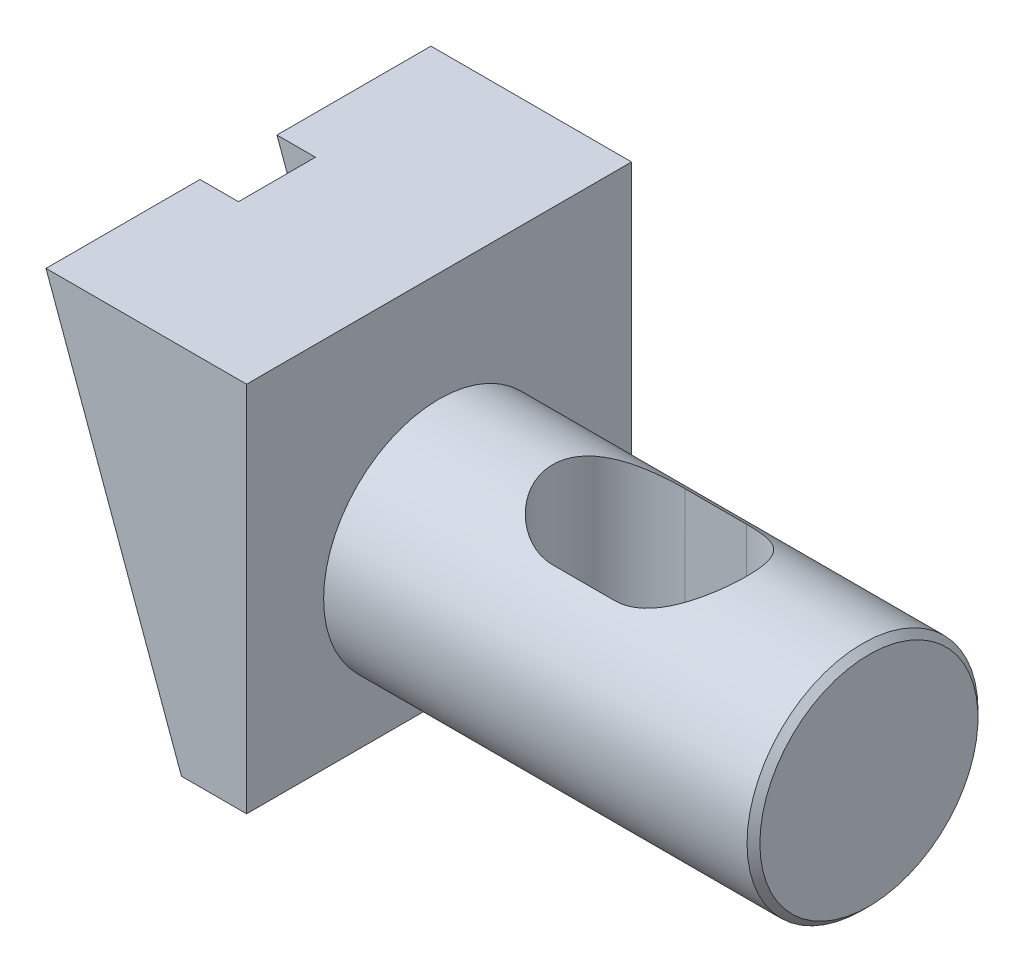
ISO-10303-21;
HEADER;
FILE_DESCRIPTION(('STEP AP214'),'2;1');
FILE_NAME('part.step','',(''),(''),'','','');
FILE_SCHEMA(('AUTOMOTIVE_DESIGN { 1 0 10303 214 1 1 1 1 }'));
ENDSEC;
DATA;
#1=APPLICATION_CONTEXT('core data for automotive mechanical design processes');
#2=APPLICATION_PROTOCOL_DEFINITION('international standard','automotive_design',2000,#1);
#3=PRODUCT_CONTEXT('',#1,'mechanical');
#4=PRODUCT('Part','Part','',(#3));
#5=PRODUCT_RELATED_PRODUCT_CATEGORY('part','',(#4));
#6=PRODUCT_DEFINITION_FORMATION('','',#4);
#7=PRODUCT_DEFINITION_CONTEXT('part definition',#1,'design');
#8=PRODUCT_DEFINITION('design','',#6,#7);
#9=PRODUCT_DEFINITION_SHAPE('','',#8);
#10=(LENGTH_UNIT() NAMED_UNIT(*) SI_UNIT(.MILLI.,.METRE.));
#11=(NAMED_UNIT(*) PLANE_ANGLE_UNIT() SI_UNIT($,.RADIAN.));
#12=(NAMED_UNIT(*) SI_UNIT($,.STERADIAN.) SOLID_ANGLE_UNIT());
#13=UNCERTAINTY_MEASURE_WITH_UNIT(LENGTH_MEASURE(1.E-05),#10,'distance_accuracy_value','');
#14=(GEOMETRIC_REPRESENTATION_CONTEXT(3) GLOBAL_UNCERTAINTY_ASSIGNED_CONTEXT((#13)) GLOBAL_UNIT_ASSIGNED_CONTEXT((#10,
#11,#12)) REPRESENTATION_CONTEXT('',''));
#15=CARTESIAN_POINT('',(0.,0.,0.));
#16=DIRECTION('',(0.,0.,1.));
#17=DIRECTION('',(1.,0.,0.));
#18=AXIS2_PLACEMENT_3D('',#15,#16,#17);
#19=CARTESIAN_POINT('',(-51.1,15.5,0.));
#20=DIRECTION('',(1.,0.,0.));
#21=DIRECTION('',(0.,0.,-1.));
#22=AXIS2_PLACEMENT_3D('',#19,#20,#21);
#23=PLANE('',#22);
#24=CARTESIAN_POINT('',(-51.1,15.5,0.));
#25=DIRECTION('',(-1.,0.,0.));
#26=DIRECTION('',(0.,0.,1.));
#27=AXIS2_PLACEMENT_3D('',#24,#25,#26);
#28=CIRCLE('',#27,7.5);
#29=CARTESIAN_POINT('',(-51.1,15.5,7.5));
#30=VERTEX_POINT('',#29);
#31=EDGE_CURVE('E253',#30,#30,#28,.T.);
#32=ORIENTED_EDGE('',*,*,#31,.T.);
#33=EDGE_LOOP('',(#32));
#34=FACE_BOUND('',#33,.T.);
#35=CARTESIAN_POINT('',(-51.1,15.5,0.));
#36=DIRECTION('',(1.,0.,0.));
#37=DIRECTION('',(0.,0.,-1.));
#38=AXIS2_PLACEMENT_3D('',#35,#36,#37);
#39=CIRCLE('',#38,2.);
#40=CARTESIAN_POINT('',(-51.1,15.5,-2.));
#41=VERTEX_POINT('',#40);
#42=EDGE_CURVE('E11',#41,#41,#39,.F.);
#43=ORIENTED_EDGE('',*,*,#42,.F.);
#44=EDGE_LOOP('',(#43));
#45=FACE_BOUND('',#44,.T.);
#46=ADVANCED_FACE('F34',(#34,#45),#23,.F.);
#47=CARTESIAN_POINT('',(-36.1,24.,0.));
#48=DIRECTION('',(-1.,0.,0.));
#49=DIRECTION('',(0.,0.,1.));
#50=AXIS2_PLACEMENT_3D('',#47,#48,#49);
#51=PLANE('',#50);
#52=CARTESIAN_POINT('',(-36.1,15.5,0.));
#53=DIRECTION('',(-1.,0.,0.));
#54=DIRECTION('',(0.,0.,1.));
#55=AXIS2_PLACEMENT_3D('',#52,#53,#54);
#56=CIRCLE('',#55,8.5);
#57=CARTESIAN_POINT('',(-36.1,15.5,8.5));
#58=VERTEX_POINT('',#57);
#59=EDGE_CURVE('E256',#58,#58,#56,.T.);
#60=ORIENTED_EDGE('',*,*,#59,.T.);
#61=EDGE_LOOP('',(#60));
#62=FACE_BOUND('',#61,.T.);
#63=CARTESIAN_POINT('',(-36.1,15.5,0.));
#64=DIRECTION('',(-1.,0.,0.));
#65=DIRECTION('',(0.,0.,1.));
#66=AXIS2_PLACEMENT_3D('',#63,#64,#65);
#67=CIRCLE('',#66,7.5);
#68=CARTESIAN_POINT('',(-36.1,15.5,7.5));
#69=VERTEX_POINT('',#68);
#70=EDGE_CURVE('E250',#69,#69,#67,.T.);
#71=ORIENTED_EDGE('',*,*,#70,.F.);
#72=EDGE_LOOP('',(#71));
#73=FACE_BOUND('',#72,.T.);
#74=ADVANCED_FACE('F432',(#62,#73),#51,.T.);
#75=CARTESIAN_POINT('',(-49.136029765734,29.,15.));
#76=DIRECTION('',(0.939692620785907,0.342020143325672,0.));
#77=DIRECTION('',(-0.342020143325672,0.939692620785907,0.));
#78=AXIS2_PLACEMENT_3D('',#75,#76,#77);
#79=PLANE('',#78);
#80=CARTESIAN_POINT('',(-44.2224316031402,15.5,0.));
#81=DIRECTION('',(0.939692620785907,0.342020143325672,0.));
#82=DIRECTION('',(-0.342020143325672,0.939692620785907,0.));
#83=AXIS2_PLACEMENT_3D('',#80,#81,#82);
#84=ELLIPSE('',#83,9.04551106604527,8.5);
#85=CARTESIAN_POINT('',(-47.1170820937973,23.4529868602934,-3.));
#86=VERTEX_POINT('',#85);
#87=CARTESIAN_POINT('',(-41.3277811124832,7.54701313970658,-3.));
#88=VERTEX_POINT('',#87);
#89=EDGE_CURVE('E265',#86,#88,#84,.F.);
#90=ORIENTED_EDGE('',*,*,#89,.F.);
#91=DIRECTION('',(0.342020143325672,-0.939692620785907,0.));
#92=VECTOR('',#91,1.);
#93=CARTESIAN_POINT('',(-49.136029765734,29.,-3.));
#94=LINE('',#93,#92);
#95=CARTESIAN_POINT('',(-49.136029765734,29.,-3.));
#96=VERTEX_POINT('',#95);
#97=EDGE_CURVE('E292',#96,#86,#94,.T.);
#98=ORIENTED_EDGE('',*,*,#97,.F.);
#99=DIRECTION('',(0.,0.,-1.));
#100=VECTOR('',#99,1.);
#101=CARTESIAN_POINT('',(-49.136029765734,29.,15.));
#102=LINE('',#101,#100);
#103=CARTESIAN_POINT('',(-49.136029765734,29.,-15.));
#104=VERTEX_POINT('',#103);
#105=EDGE_CURVE('E339',#96,#104,#102,.T.);
#106=ORIENTED_EDGE('',*,*,#105,.T.);
#107=DIRECTION('',(0.342020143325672,-0.939692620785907,0.));
#108=VECTOR('',#107,1.);
#109=CARTESIAN_POINT('',(-49.136029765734,29.,-15.));
#110=LINE('',#109,#108);
#111=CARTESIAN_POINT('',(-38.580892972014,0.,-15.));
#112=VERTEX_POINT('',#111);
#113=EDGE_CURVE('E313',#104,#112,#110,.T.);
#114=ORIENTED_EDGE('',*,*,#113,.T.);
#115=DIRECTION('',(0.,0.,-1.));
#116=VECTOR('',#115,1.);
#117=CARTESIAN_POINT('',(-38.580892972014,0.,15.));
#118=LINE('',#117,#116);
#119=CARTESIAN_POINT('',(-38.580892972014,0.,-3.));
#120=VERTEX_POINT('',#119);
#121=EDGE_CURVE('E335',#120,#112,#118,.T.);
#122=ORIENTED_EDGE('',*,*,#121,.F.);
#123=EDGE_CURVE('E291',#88,#120,#94,.T.);
#124=ORIENTED_EDGE('',*,*,#123,.F.);
#125=EDGE_LOOP('',(#90,#98,#106,#114,#122,#124));
#126=FACE_BOUND('',#125,.T.);
#127=ADVANCED_FACE('F438',(#126),#79,.F.);
#128=CARTESIAN_POINT('',(-44.2224316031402,15.5,0.));
#129=DIRECTION('',(0.939692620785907,0.342020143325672,0.));
#130=DIRECTION('',(-0.342020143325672,0.939692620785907,0.));
#131=AXIS2_PLACEMENT_3D('',#128,#129,#130);
#132=ELLIPSE('',#131,9.04551106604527,8.5);
#133=CARTESIAN_POINT('',(-41.3277811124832,7.54701313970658,3.));
#134=VERTEX_POINT('',#133);
#135=CARTESIAN_POINT('',(-47.1170820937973,23.4529868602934,3.));
#136=VERTEX_POINT('',#135);
#137=EDGE_CURVE('E263',#134,#136,#132,.F.);
#138=ORIENTED_EDGE('',*,*,#137,.F.);
#139=DIRECTION('',(0.342020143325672,-0.939692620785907,0.));
#140=VECTOR('',#139,1.);
#141=CARTESIAN_POINT('',(-49.136029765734,29.,3.));
#142=LINE('',#141,#140);
#143=CARTESIAN_POINT('',(-38.580892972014,0.,3.));
#144=VERTEX_POINT('',#143);
#145=EDGE_CURVE('E295',#134,#144,#142,.T.);
#146=ORIENTED_EDGE('',*,*,#145,.T.);
#147=CARTESIAN_POINT('',(-38.580892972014,0.,15.));
#148=VERTEX_POINT('',#147);
#149=EDGE_CURVE('E336',#148,#144,#118,.T.);
#150=ORIENTED_EDGE('',*,*,#149,.F.);
#151=DIRECTION('',(0.342020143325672,-0.939692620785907,0.));
#152=VECTOR('',#151,1.);
#153=CARTESIAN_POINT('',(-49.136029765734,29.,15.));
#154=LINE('',#153,#152);
#155=CARTESIAN_POINT('',(-49.136029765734,29.,15.));
#156=VERTEX_POINT('',#155);
#157=EDGE_CURVE('E325',#156,#148,#154,.T.);
#158=ORIENTED_EDGE('',*,*,#157,.F.);
#159=CARTESIAN_POINT('',(-49.136029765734,29.,3.));
#160=VERTEX_POINT('',#159);
#161=EDGE_CURVE('E340',#156,#160,#102,.T.);
#162=ORIENTED_EDGE('',*,*,#161,.T.);
#163=EDGE_CURVE('E296',#160,#136,#142,.T.);
#164=ORIENTED_EDGE('',*,*,#163,.T.);
#165=EDGE_LOOP('',(#138,#146,#150,#158,#162,#164));
#166=FACE_BOUND('',#165,.T.);
#167=ADVANCED_FACE('F457',(#166),#79,.F.);
#168=CARTESIAN_POINT('',(-58.5,0.,3.));
#169=DIRECTION('',(0.,0.,1.));
#170=DIRECTION('',(1.,0.,0.));
#171=AXIS2_PLACEMENT_3D('',#168,#169,#170);
#172=PLANE('',#171);
#173=DIRECTION('',(-1.,0.,0.));
#174=VECTOR('',#173,1.);
#175=CARTESIAN_POINT('',(-36.1,23.4529868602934,3.));
#176=LINE('',#175,#174);
#177=CARTESIAN_POINT('',(-44.1170820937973,23.4529868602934,3.));
#178=VERTEX_POINT('',#177);
#179=EDGE_CURVE('E58',#136,#178,#176,.F.);
#180=ORIENTED_EDGE('',*,*,#179,.F.);
#181=ORIENTED_EDGE('',*,*,#163,.F.);
#182=DIRECTION('',(-1.,0.,0.));
#183=VECTOR('',#182,1.);
#184=CARTESIAN_POINT('',(-46.136029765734,29.,3.));
#185=LINE('',#184,#183);
#186=CARTESIAN_POINT('',(-46.136029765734,29.,3.));
#187=VERTEX_POINT('',#186);
#188=EDGE_CURVE('E282',#187,#160,#185,.T.);
#189=ORIENTED_EDGE('',*,*,#188,.F.);
#190=DIRECTION('',(-0.342020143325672,0.939692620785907,0.));
#191=VECTOR('',#190,1.);
#192=CARTESIAN_POINT('',(-35.580892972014,0.,3.));
#193=LINE('',#192,#191);
#194=EDGE_CURVE('E278',#178,#187,#193,.T.);
#195=ORIENTED_EDGE('',*,*,#194,.F.);
#196=EDGE_LOOP('',(#180,#181,#189,#195));
#197=FACE_BOUND('',#196,.T.);
#198=ADVANCED_FACE('F455',(#197),#172,.F.);
#199=DIRECTION('',(-1.,0.,0.));
#200=VECTOR('',#199,1.);
#201=CARTESIAN_POINT('',(-36.1,7.54701313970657,3.));
#202=LINE('',#201,#200);
#203=CARTESIAN_POINT('',(-38.3277811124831,7.54701313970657,3.));
#204=VERTEX_POINT('',#203);
#205=EDGE_CURVE('E270',#204,#134,#202,.T.);
#206=ORIENTED_EDGE('',*,*,#205,.F.);
#207=CARTESIAN_POINT('',(-35.580892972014,0.,3.));
#208=VERTEX_POINT('',#207);
#209=EDGE_CURVE('E279',#208,#204,#193,.T.);
#210=ORIENTED_EDGE('',*,*,#209,.F.);
#211=DIRECTION('',(1.,0.,0.));
#212=VECTOR('',#211,1.);
#213=CARTESIAN_POINT('',(-38.580892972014,0.,3.));
#214=LINE('',#213,#212);
#215=EDGE_CURVE('E473',#144,#208,#214,.T.);
#216=ORIENTED_EDGE('',*,*,#215,.F.);
#217=ORIENTED_EDGE('',*,*,#145,.F.);
#218=EDGE_LOOP('',(#206,#210,#216,#217));
#219=FACE_BOUND('',#218,.T.);
#220=ADVANCED_FACE('F453',(#219),#172,.F.);
#221=CARTESIAN_POINT('',(-58.5,0.,-3.));
#222=DIRECTION('',(0.,0.,1.));
#223=DIRECTION('',(1.,0.,0.));
#224=AXIS2_PLACEMENT_3D('',#221,#222,#223);
#225=PLANE('',#224);
#226=ORIENTED_EDGE('',*,*,#97,.T.);
#227=DIRECTION('',(-1.,0.,0.));
#228=VECTOR('',#227,1.);
#229=CARTESIAN_POINT('',(-36.1,23.4529868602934,-3.));
#230=LINE('',#229,#228);
#231=CARTESIAN_POINT('',(-44.1170820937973,23.4529868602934,-3.));
#232=VERTEX_POINT('',#231);
#233=EDGE_CURVE('E259',#86,#232,#230,.F.);
#234=ORIENTED_EDGE('',*,*,#233,.T.);
#235=DIRECTION('',(-0.342020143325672,0.939692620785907,0.));
#236=VECTOR('',#235,1.);
#237=CARTESIAN_POINT('',(-35.580892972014,0.,-3.));
#238=LINE('',#237,#236);
#239=CARTESIAN_POINT('',(-46.136029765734,29.,-3.));
#240=VERTEX_POINT('',#239);
#241=EDGE_CURVE('E272',#232,#240,#238,.T.);
#242=ORIENTED_EDGE('',*,*,#241,.T.);
#243=DIRECTION('',(-1.,0.,0.));
#244=VECTOR('',#243,1.);
#245=CARTESIAN_POINT('',(-46.136029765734,29.,-3.));
#246=LINE('',#245,#244);
#247=EDGE_CURVE('E276',#240,#96,#246,.T.);
#248=ORIENTED_EDGE('',*,*,#247,.T.);
#249=EDGE_LOOP('',(#226,#234,#242,#248));
#250=FACE_BOUND('',#249,.T.);
#251=ADVANCED_FACE('F449',(#250),#225,.T.);
#252=CARTESIAN_POINT('',(-35.580892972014,0.,-3.));
#253=VERTEX_POINT('',#252);
#254=CARTESIAN_POINT('',(-38.3277811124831,7.54701313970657,-3.));
#255=VERTEX_POINT('',#254);
#256=EDGE_CURVE('E273',#253,#255,#238,.T.);
#257=ORIENTED_EDGE('',*,*,#256,.T.);
#258=DIRECTION('',(-1.,0.,0.));
#259=VECTOR('',#258,1.);
#260=CARTESIAN_POINT('',(-36.1,7.54701313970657,-3.));
#261=LINE('',#260,#259);
#262=EDGE_CURVE('E267',#255,#88,#261,.T.);
#263=ORIENTED_EDGE('',*,*,#262,.T.);
#264=ORIENTED_EDGE('',*,*,#123,.T.);
#265=DIRECTION('',(1.,0.,0.));
#266=VECTOR('',#265,1.);
#267=CARTESIAN_POINT('',(-38.580892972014,0.,-3.));
#268=LINE('',#267,#266);
#269=EDGE_CURVE('E389',#120,#253,#268,.T.);
#270=ORIENTED_EDGE('',*,*,#269,.T.);
#271=EDGE_LOOP('',(#257,#263,#264,#270));
#272=FACE_BOUND('',#271,.T.);
#273=ADVANCED_FACE('F452',(#272),#225,.T.);
#274=CARTESIAN_POINT('',(-35.580892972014,0.,3.));
#275=DIRECTION('',(-0.939692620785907,-0.342020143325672,0.));
#276=DIRECTION('',(0.342020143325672,-0.939692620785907,0.));
#277=AXIS2_PLACEMENT_3D('',#274,#275,#276);
#278=PLANE('',#277);
#279=ORIENTED_EDGE('',*,*,#209,.T.);
#280=CARTESIAN_POINT('',(-41.2224316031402,15.5,0.));
#281=DIRECTION('',(-0.939692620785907,-0.342020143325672,0.));
#282=DIRECTION('',(-0.342020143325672,0.939692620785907,0.));
#283=AXIS2_PLACEMENT_3D('',#280,#281,#282);
#284=ELLIPSE('',#283,9.04551106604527,8.5);
#285=EDGE_CURVE('E43',#204,#255,#284,.F.);
#286=ORIENTED_EDGE('',*,*,#285,.T.);
#287=ORIENTED_EDGE('',*,*,#256,.F.);
#288=DIRECTION('',(0.,0.,-1.));
#289=VECTOR('',#288,1.);
#290=CARTESIAN_POINT('',(-35.580892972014,0.,3.));
#291=LINE('',#290,#289);
#292=EDGE_CURVE('E288',#208,#253,#291,.T.);
#293=ORIENTED_EDGE('',*,*,#292,.F.);
#294=EDGE_LOOP('',(#279,#286,#287,#293));
#295=FACE_BOUND('',#294,.T.);
#296=ADVANCED_FACE('F429',(#295),#278,.T.);
#297=ORIENTED_EDGE('',*,*,#241,.F.);
#298=EDGE_CURVE('E479',#232,#178,#284,.F.);
#299=ORIENTED_EDGE('',*,*,#298,.T.);
#300=ORIENTED_EDGE('',*,*,#194,.T.);
#301=DIRECTION('',(0.,0.,-1.));
#302=VECTOR('',#301,1.);
#303=CARTESIAN_POINT('',(-46.136029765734,29.,3.));
#304=LINE('',#303,#302);
#305=EDGE_CURVE('E285',#187,#240,#304,.T.);
#306=ORIENTED_EDGE('',*,*,#305,.T.);
#307=EDGE_LOOP('',(#297,#299,#300,#306));
#308=FACE_BOUND('',#307,.T.);
#309=ADVANCED_FACE('F422',(#308),#278,.T.);
#310=CARTESIAN_POINT('',(0.,11.5,0.));
#311=DIRECTION('',(-1.,0.,0.));
#312=DIRECTION('',(0.,0.,1.));
#313=AXIS2_PLACEMENT_3D('',#310,#311,#312);
#314=CYLINDRICAL_SURFACE('',#313,9.);
#315=CARTESIAN_POINT('',(-19.5,4.11911251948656,5.15));
#316=CARTESIAN_POINT('',(-19.6316313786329,4.11916277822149,5.15002763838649));
#317=CARTESIAN_POINT('',(-19.7632338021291,4.11559254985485,5.14495444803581));
#318=CARTESIAN_POINT('',(-20.025196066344,4.10159238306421,5.12482541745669));
#319=CARTESIAN_POINT('',(-20.1555568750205,4.09116832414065,5.10977813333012));
#320=CARTESIAN_POINT('',(-20.4131346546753,4.0639405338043,5.07006506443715));
#321=CARTESIAN_POINT('',(-20.5403676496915,4.04718404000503,5.04547046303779));
#322=CARTESIAN_POINT('',(-20.7917739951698,4.00795447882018,4.9870324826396));
#323=CARTESIAN_POINT('',(-20.9159468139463,3.98548042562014,4.95318750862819));
#324=CARTESIAN_POINT('',(-21.2819234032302,3.91079860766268,4.83863073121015));
#325=CARTESIAN_POINT('',(-21.5182311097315,3.85120998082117,4.74473138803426));
#326=CARTESIAN_POINT('',(-21.9719164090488,3.71922672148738,4.52503539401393));
#327=CARTESIAN_POINT('',(-22.1892538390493,3.64680585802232,4.39917317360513));
#328=CARTESIAN_POINT('',(-22.6246404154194,3.48779385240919,4.10314275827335));
#329=CARTESIAN_POINT('',(-22.84016992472,3.40051910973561,3.92963517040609));
#330=CARTESIAN_POINT('',(-23.2411412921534,3.22709656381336,3.55000595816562));
#331=CARTESIAN_POINT('',(-23.4265730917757,3.1409491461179,3.34387347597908));
#332=CARTESIAN_POINT('',(-23.6871361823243,3.01453309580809,3.0022591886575));
#333=CARTESIAN_POINT('',(-23.7742586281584,2.97111647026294,2.87691702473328));
#334=CARTESIAN_POINT('',(-23.9375132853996,2.88814346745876,2.61808344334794));
#335=CARTESIAN_POINT('',(-24.0136499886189,2.84858551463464,2.48459538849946));
#336=CARTESIAN_POINT('',(-24.1541265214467,2.77447211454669,2.21028201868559));
#337=CARTESIAN_POINT('',(-24.2184705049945,2.73991490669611,2.06945930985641));
#338=CARTESIAN_POINT('',(-24.3345786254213,2.67683318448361,1.781417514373));
#339=CARTESIAN_POINT('',(-24.3863446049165,2.64830778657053,1.63419936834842));
#340=CARTESIAN_POINT('',(-24.4725367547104,2.60042380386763,1.34785522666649));
#341=CARTESIAN_POINT('',(-24.5080925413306,2.58047712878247,1.20916719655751));
#342=CARTESIAN_POINT('',(-24.5676224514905,2.54691722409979,0.928581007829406));
#343=CARTESIAN_POINT('',(-24.5915981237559,2.533303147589,0.786683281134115));
#344=CARTESIAN_POINT('',(-24.6275946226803,2.51281425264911,0.50098889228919));
#345=CARTESIAN_POINT('',(-24.6396232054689,2.50593506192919,0.357193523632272));
#346=CARTESIAN_POINT('',(-24.651557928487,2.49910983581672,0.068941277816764));
#347=CARTESIAN_POINT('',(-24.6514651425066,2.49916318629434,-0.0755155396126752));
#348=CARTESIAN_POINT('',(-24.6398627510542,2.50579781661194,-0.34737466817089));
#349=CARTESIAN_POINT('',(-24.6296492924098,2.51163797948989,-0.474852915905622));
#350=CARTESIAN_POINT('',(-24.5998283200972,2.52862337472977,-0.728387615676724));
#351=CARTESIAN_POINT('',(-24.5802179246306,2.53977023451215,-0.854443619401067));
#352=CARTESIAN_POINT('',(-24.5318430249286,2.56710883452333,-1.1041843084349));
#353=CARTESIAN_POINT('',(-24.5030817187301,2.58329881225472,-1.22786980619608));
#354=CARTESIAN_POINT('',(-24.4367318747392,2.6203562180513,-1.4721497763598));
#355=CARTESIAN_POINT('',(-24.3991399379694,2.64122544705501,-1.59274303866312));
#356=CARTESIAN_POINT('',(-24.2729648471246,2.71059396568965,-1.95078966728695));
#357=CARTESIAN_POINT('',(-24.1713677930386,2.76562959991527,-2.18254696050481));
#358=CARTESIAN_POINT('',(-23.9373122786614,2.88853364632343,-2.62598165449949));
#359=CARTESIAN_POINT('',(-23.8048449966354,2.9564057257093,-2.83765329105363));
#360=CARTESIAN_POINT('',(-23.495811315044,3.10810854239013,-3.26069824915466));
#361=CARTESIAN_POINT('',(-23.3159512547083,3.19287603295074,-3.46932843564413));
#362=CARTESIAN_POINT('',(-22.9256263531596,3.36478696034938,-3.85525714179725));
#363=CARTESIAN_POINT('',(-22.7151189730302,3.45193356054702,-4.03251134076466));
#364=CARTESIAN_POINT('',(-22.367889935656,3.58234507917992,-4.28026511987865));
#365=CARTESIAN_POINT('',(-22.240495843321,3.62773840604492,-4.36295432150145));
#366=CARTESIAN_POINT('',(-21.977974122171,3.71523669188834,-4.51722423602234));
#367=CARTESIAN_POINT('',(-21.8428445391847,3.75734081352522,-4.5888021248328));
#368=CARTESIAN_POINT('',(-21.5659443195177,3.83657535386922,-4.71993468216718));
#369=CARTESIAN_POINT('',(-21.4241924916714,3.87371882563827,-4.77952112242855));
#370=CARTESIAN_POINT('',(-21.1346392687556,3.94157559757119,-4.88612508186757));
#371=CARTESIAN_POINT('',(-20.9868428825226,3.97229409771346,-4.9331527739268));
#372=CARTESIAN_POINT('',(-20.7290535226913,4.01823108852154,-5.00243268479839));
#373=CARTESIAN_POINT('',(-20.6202632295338,4.0353731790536,-5.02792730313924));
#374=CARTESIAN_POINT('',(-20.4006803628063,4.06515659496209,-5.07186413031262));
#375=CARTESIAN_POINT('',(-20.289888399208,4.07779926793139,-5.09030845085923));
#376=CARTESIAN_POINT('',(-20.0663257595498,4.09825669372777,-5.12001394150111));
#377=CARTESIAN_POINT('',(-19.9535479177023,4.10604675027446,-5.13123837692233));
#378=CARTESIAN_POINT('',(-19.7271849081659,4.11649078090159,-5.14624199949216));
#379=CARTESIAN_POINT('',(-19.6135992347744,4.11914118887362,-5.15001601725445));
#380=CARTESIAN_POINT('',(-19.5,4.11911251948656,-5.15));
#381=B_SPLINE_CURVE_WITH_KNOTS('',3,(#315,#316,#317,#318,#319,#320,#321,#322,#323,#324,#325,
#326,#327,#328,#329,#330,#331,#332,#333,#334,#335,#336,#337,#338,#339,#340,#341,#342,#343,#344,
#345,#346,#347,#348,#349,#350,#351,#352,#353,#354,#355,#356,#357,#358,#359,#360,#361,#362,#363,
#364,#365,#366,#367,#368,#369,#370,#371,#372,#373,#374,#375,#376,#377,#378,#379,#380),
.UNSPECIFIED.,.F.,.F.,(4,2,2,2,2,2,2,2,2,2,2,2,2,2,2,2,2,2,2,2,2,2,2,2,2,2,2,2,2,2,2,2,4),(0.,
0.394700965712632,0.789063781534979,1.18054107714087,1.57208591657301,2.35201880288,
3.13356477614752,4.00055056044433,4.86782549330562,5.34339177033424,5.81876304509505,
6.29396654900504,6.76910039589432,7.20215657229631,7.63515481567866,8.06787176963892,
8.50055039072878,8.8841524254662,9.26787217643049,9.6514579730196,10.0351916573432,
10.8086275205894,11.5822846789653,12.443470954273,13.3058641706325,13.7809017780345,
14.2560599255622,14.729942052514,15.2034391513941,15.5422767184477,15.8810127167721,
16.221458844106,16.5621411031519),.UNSPECIFIED.);
#382=CARTESIAN_POINT('',(-19.5,4.11911251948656,5.15));
#383=VERTEX_POINT('',#382);
#384=CARTESIAN_POINT('',(-19.5,4.11911251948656,-5.15));
#385=VERTEX_POINT('',#384);
#386=EDGE_CURVE('E399',#383,#385,#381,.T.);
#387=ORIENTED_EDGE('',*,*,#386,.F.);
#388=DIRECTION('',(-1.,0.,0.));
#389=VECTOR('',#388,1.);
#390=CARTESIAN_POINT('',(0.,4.11911251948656,5.15));
#391=LINE('',#390,#389);
#392=CARTESIAN_POINT('',(-14.7,4.11911251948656,5.15));
#393=VERTEX_POINT('',#392);
#394=EDGE_CURVE('E360',#393,#383,#391,.T.);
#395=ORIENTED_EDGE('',*,*,#394,.F.);
#396=CARTESIAN_POINT('',(-14.7,4.11911251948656,-5.15));
#397=CARTESIAN_POINT('',(-14.568368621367,4.11916277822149,-5.15002763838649));
#398=CARTESIAN_POINT('',(-14.4367661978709,4.11559254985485,-5.14495444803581));
#399=CARTESIAN_POINT('',(-14.174803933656,4.10159238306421,-5.12482541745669));
#400=CARTESIAN_POINT('',(-14.0444431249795,4.09116832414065,-5.10977813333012));
#401=CARTESIAN_POINT('',(-13.7868653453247,4.0639405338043,-5.07006506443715));
#402=CARTESIAN_POINT('',(-13.6596323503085,4.04718404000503,-5.04547046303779));
#403=CARTESIAN_POINT('',(-13.4082260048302,4.00795447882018,-4.9870324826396));
#404=CARTESIAN_POINT('',(-13.2840531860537,3.98548042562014,-4.95318750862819));
#405=CARTESIAN_POINT('',(-12.9180765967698,3.91079860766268,-4.83863073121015));
#406=CARTESIAN_POINT('',(-12.6817688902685,3.85120998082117,-4.74473138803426));
#407=CARTESIAN_POINT('',(-12.2280835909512,3.71922672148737,-4.52503539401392));
#408=CARTESIAN_POINT('',(-12.0107461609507,3.64680585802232,-4.39917317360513));
#409=CARTESIAN_POINT('',(-11.5753595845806,3.48779385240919,-4.10314275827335));
#410=CARTESIAN_POINT('',(-11.35983007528,3.40051910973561,-3.92963517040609));
#411=CARTESIAN_POINT('',(-10.9588587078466,3.22709656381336,-3.55000595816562));
#412=CARTESIAN_POINT('',(-10.7734269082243,3.1409491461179,-3.34387347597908));
#413=CARTESIAN_POINT('',(-10.5128638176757,3.01453309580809,-3.00225918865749));
#414=CARTESIAN_POINT('',(-10.4257413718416,2.97111647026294,-2.87691702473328));
#415=CARTESIAN_POINT('',(-10.2624867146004,2.88814346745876,-2.61808344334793));
#416=CARTESIAN_POINT('',(-10.1863500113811,2.84858551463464,-2.48459538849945));
#417=CARTESIAN_POINT('',(-10.0458734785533,2.77447211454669,-2.21028201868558));
#418=CARTESIAN_POINT('',(-9.98152949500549,2.73991490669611,-2.0694593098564));
#419=CARTESIAN_POINT('',(-9.86542137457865,2.67683318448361,-1.781417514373));
#420=CARTESIAN_POINT('',(-9.81365539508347,2.64830778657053,-1.63419936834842));
#421=CARTESIAN_POINT('',(-9.72746324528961,2.60042380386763,-1.34785522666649));
#422=CARTESIAN_POINT('',(-9.69190745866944,2.58047712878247,-1.20916719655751));
#423=CARTESIAN_POINT('',(-9.63237754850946,2.54691722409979,-0.928581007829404));
#424=CARTESIAN_POINT('',(-9.60840187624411,2.533303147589,-0.786683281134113));
#425=CARTESIAN_POINT('',(-9.57240537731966,2.51281425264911,-0.50098889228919));
#426=CARTESIAN_POINT('',(-9.5603767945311,2.50593506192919,-0.357193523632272));
#427=CARTESIAN_POINT('',(-9.54844207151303,2.49910983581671,-0.0689412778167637));
#428=CARTESIAN_POINT('',(-9.54853485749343,2.49916318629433,0.0755155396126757));
#429=CARTESIAN_POINT('',(-9.56013724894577,2.50579781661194,0.347374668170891));
#430=CARTESIAN_POINT('',(-9.57035070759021,2.51163797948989,0.474852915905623));
#431=CARTESIAN_POINT('',(-9.60017167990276,2.52862337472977,0.728387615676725));
#432=CARTESIAN_POINT('',(-9.61978207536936,2.53977023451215,0.854443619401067));
#433=CARTESIAN_POINT('',(-9.66815697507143,2.56710883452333,1.1041843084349));
#434=CARTESIAN_POINT('',(-9.69691828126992,2.58329881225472,1.22786980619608));
#435=CARTESIAN_POINT('',(-9.76326812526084,2.6203562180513,1.4721497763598));
#436=CARTESIAN_POINT('',(-9.80086006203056,2.64122544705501,1.59274303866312));
#437=CARTESIAN_POINT('',(-9.92703515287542,2.71059396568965,1.95078966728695));
#438=CARTESIAN_POINT('',(-10.0286322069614,2.76562959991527,2.18254696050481));
#439=CARTESIAN_POINT('',(-10.2626877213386,2.88853364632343,2.6259816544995));
#440=CARTESIAN_POINT('',(-10.3951550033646,2.9564057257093,2.83765329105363));
#441=CARTESIAN_POINT('',(-10.704188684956,3.10810854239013,3.26069824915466));
#442=CARTESIAN_POINT('',(-10.8840487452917,3.19287603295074,3.46932843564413));
#443=CARTESIAN_POINT('',(-11.2743736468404,3.36478696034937,3.85525714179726));
#444=CARTESIAN_POINT('',(-11.4848810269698,3.45193356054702,4.03251134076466));
#445=CARTESIAN_POINT('',(-11.832110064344,3.58234507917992,4.28026511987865));
#446=CARTESIAN_POINT('',(-11.959504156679,3.62773840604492,4.36295432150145));
#447=CARTESIAN_POINT('',(-12.222025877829,3.71523669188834,4.51722423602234));
#448=CARTESIAN_POINT('',(-12.3571554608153,3.75734081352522,4.58880212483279));
#449=CARTESIAN_POINT('',(-12.6340556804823,3.83657535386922,4.71993468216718));
#450=CARTESIAN_POINT('',(-12.7758075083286,3.87371882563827,4.77952112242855));
#451=CARTESIAN_POINT('',(-13.0653607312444,3.94157559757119,4.88612508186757));
#452=CARTESIAN_POINT('',(-13.2131571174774,3.97229409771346,4.93315277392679));
#453=CARTESIAN_POINT('',(-13.4709464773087,4.01823108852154,5.00243268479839));
#454=CARTESIAN_POINT('',(-13.5797367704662,4.03537317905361,5.02792730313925));
#455=CARTESIAN_POINT('',(-13.7993196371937,4.06515659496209,5.07186413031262));
#456=CARTESIAN_POINT('',(-13.910111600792,4.07779926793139,5.09030845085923));
#457=CARTESIAN_POINT('',(-14.1336742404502,4.09825669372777,5.12001394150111));
#458=CARTESIAN_POINT('',(-14.2464520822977,4.10604675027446,5.13123837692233));
#459=CARTESIAN_POINT('',(-14.4728150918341,4.11649078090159,5.14624199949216));
#460=CARTESIAN_POINT('',(-14.5864007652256,4.11914118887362,5.15001601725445));
#461=CARTESIAN_POINT('',(-14.7,4.11911251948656,5.15));
#462=B_SPLINE_CURVE_WITH_KNOTS('',3,(#396,#397,#398,#399,#400,#401,#402,#403,#404,#405,#406,
#407,#408,#409,#410,#411,#412,#413,#414,#415,#416,#417,#418,#419,#420,#421,#422,#423,#424,#425,
#426,#427,#428,#429,#430,#431,#432,#433,#434,#435,#436,#437,#438,#439,#440,#441,#442,#443,#444,
#445,#446,#447,#448,#449,#450,#451,#452,#453,#454,#455,#456,#457,#458,#459,#460,#461),
.UNSPECIFIED.,.F.,.F.,(4,2,2,2,2,2,2,2,2,2,2,2,2,2,2,2,2,2,2,2,2,2,2,2,2,2,2,2,2,2,2,2,4),(0.,
0.394700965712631,0.789063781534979,1.18054107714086,1.57208591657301,2.35201880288,
3.13356477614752,4.00055056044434,4.86782549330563,5.34339177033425,5.81876304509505,
6.29396654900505,6.76910039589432,7.20215657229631,7.63515481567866,8.06787176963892,
8.50055039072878,8.8841524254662,9.26787217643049,9.65145797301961,10.0351916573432,
10.8086275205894,11.5822846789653,12.443470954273,13.3058641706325,13.7809017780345,
14.2560599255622,14.729942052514,15.2034391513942,15.5422767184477,15.8810127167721,
16.221458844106,16.5621411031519),.UNSPECIFIED.);
#463=CARTESIAN_POINT('',(-14.7,4.11911251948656,-5.15));
#464=VERTEX_POINT('',#463);
#465=EDGE_CURVE('E354',#464,#393,#462,.T.);
#466=ORIENTED_EDGE('',*,*,#465,.F.);
#467=DIRECTION('',(-1.,0.,0.));
#468=VECTOR('',#467,1.);
#469=CARTESIAN_POINT('',(0.,4.11911251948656,-5.15));
#470=LINE('',#469,#468);
#471=EDGE_CURVE('E352',#385,#464,#470,.F.);
#472=ORIENTED_EDGE('',*,*,#471,.F.);
#473=EDGE_LOOP('',(#387,#395,#466,#472));
#474=FACE_BOUND('',#473,.T.);
#475=CARTESIAN_POINT('',(-33.5,11.5,0.));
#476=DIRECTION('',(-1.,0.,0.));
#477=DIRECTION('',(0.,0.,1.));
#478=AXIS2_PLACEMENT_3D('',#475,#476,#477);
#479=CIRCLE('',#478,9.);
#480=CARTESIAN_POINT('',(-33.5,11.5,9.));
#481=VERTEX_POINT('',#480);
#482=EDGE_CURVE('E349',#481,#481,#479,.T.);
#483=ORIENTED_EDGE('',*,*,#482,.F.);
#484=EDGE_LOOP('',(#483));
#485=FACE_BOUND('',#484,.T.);
#486=CARTESIAN_POINT('',(-0.5,11.5,0.));
#487=DIRECTION('',(-1.,0.,0.));
#488=DIRECTION('',(0.,0.,1.));
#489=AXIS2_PLACEMENT_3D('',#486,#487,#488);
#490=CIRCLE('',#489,9.);
#491=CARTESIAN_POINT('',(-0.5,11.5,9.));
#492=VERTEX_POINT('',#491);
#493=EDGE_CURVE('E346',#492,#492,#490,.T.);
#494=ORIENTED_EDGE('',*,*,#493,.T.);
#495=EDGE_LOOP('',(#494));
#496=FACE_BOUND('',#495,.T.);
#497=CARTESIAN_POINT('',(-19.5,18.8808874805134,-5.15));
#498=CARTESIAN_POINT('',(-19.631631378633,18.8808372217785,-5.15002763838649));
#499=CARTESIAN_POINT('',(-19.7632338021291,18.8844074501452,-5.14495444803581));
#500=CARTESIAN_POINT('',(-20.025196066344,18.8984076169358,-5.12482541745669));
#501=CARTESIAN_POINT('',(-20.1555568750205,18.9088316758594,-5.10977813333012));
#502=CARTESIAN_POINT('',(-20.4131346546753,18.9360594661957,-5.07006506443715));
#503=CARTESIAN_POINT('',(-20.5403676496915,18.952815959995,-5.04547046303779));
#504=CARTESIAN_POINT('',(-20.7917739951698,18.9920455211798,-4.9870324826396));
#505=CARTESIAN_POINT('',(-20.9159468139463,19.0145195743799,-4.95318750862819));
#506=CARTESIAN_POINT('',(-21.2819234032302,19.0892013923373,-4.83863073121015));
#507=CARTESIAN_POINT('',(-21.5182311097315,19.1487900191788,-4.74473138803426));
#508=CARTESIAN_POINT('',(-21.9719164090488,19.2807732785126,-4.52503539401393));
#509=CARTESIAN_POINT('',(-22.1892538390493,19.3531941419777,-4.39917317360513));
#510=CARTESIAN_POINT('',(-22.6246404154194,19.5122061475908,-4.10314275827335));
#511=CARTESIAN_POINT('',(-22.84016992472,19.5994808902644,-3.92963517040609));
#512=CARTESIAN_POINT('',(-23.2411412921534,19.7729034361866,-3.55000595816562));
#513=CARTESIAN_POINT('',(-23.4265730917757,19.8590508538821,-3.34387347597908));
#514=CARTESIAN_POINT('',(-23.6871361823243,19.9854669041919,-3.00225918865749));
#515=CARTESIAN_POINT('',(-23.7742586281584,20.0288835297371,-2.87691702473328));
#516=CARTESIAN_POINT('',(-23.9375132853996,20.1118565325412,-2.61808344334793));
#517=CARTESIAN_POINT('',(-24.0136499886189,20.1514144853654,-2.48459538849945));
#518=CARTESIAN_POINT('',(-24.1541265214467,20.2255278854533,-2.21028201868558));
#519=CARTESIAN_POINT('',(-24.2184705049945,20.2600850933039,-2.0694593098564));
#520=CARTESIAN_POINT('',(-24.3345786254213,20.3231668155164,-1.781417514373));
#521=CARTESIAN_POINT('',(-24.3863446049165,20.3516922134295,-1.63419936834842));
#522=CARTESIAN_POINT('',(-24.4725367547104,20.3995761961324,-1.34785522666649));
#523=CARTESIAN_POINT('',(-24.5080925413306,20.4195228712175,-1.20916719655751));
#524=CARTESIAN_POINT('',(-24.5676224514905,20.4530827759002,-0.928581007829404));
#525=CARTESIAN_POINT('',(-24.5915981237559,20.466696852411,-0.786683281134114));
#526=CARTESIAN_POINT('',(-24.6275946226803,20.4871857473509,-0.50098889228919));
#527=CARTESIAN_POINT('',(-24.6396232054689,20.4940649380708,-0.357193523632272));
#528=CARTESIAN_POINT('',(-24.651557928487,20.5008901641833,-0.0689412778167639));
#529=CARTESIAN_POINT('',(-24.6514651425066,20.5008368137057,0.0755155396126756));
#530=CARTESIAN_POINT('',(-24.6398627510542,20.4942021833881,0.347374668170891));
#531=CARTESIAN_POINT('',(-24.6296492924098,20.4883620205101,0.474852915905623));
#532=CARTESIAN_POINT('',(-24.5998283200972,20.4713766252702,0.728387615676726));
#533=CARTESIAN_POINT('',(-24.5802179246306,20.4602297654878,0.854443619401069));
#534=CARTESIAN_POINT('',(-24.5318430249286,20.4328911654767,1.10418430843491));
#535=CARTESIAN_POINT('',(-24.5030817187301,20.4167011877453,1.22786980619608));
#536=CARTESIAN_POINT('',(-24.4367318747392,20.3796437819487,1.4721497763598));
#537=CARTESIAN_POINT('',(-24.3991399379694,20.358774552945,1.59274303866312));
#538=CARTESIAN_POINT('',(-24.2729648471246,20.2894060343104,1.95078966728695));
#539=CARTESIAN_POINT('',(-24.1713677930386,20.2343704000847,2.18254696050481));
#540=CARTESIAN_POINT('',(-23.9373122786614,20.1114663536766,2.6259816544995));
#541=CARTESIAN_POINT('',(-23.8048449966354,20.0435942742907,2.83765329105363));
#542=CARTESIAN_POINT('',(-23.495811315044,19.8918914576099,3.26069824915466));
#543=CARTESIAN_POINT('',(-23.3159512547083,19.8071239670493,3.46932843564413));
#544=CARTESIAN_POINT('',(-22.9256263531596,19.6352130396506,3.85525714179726));
#545=CARTESIAN_POINT('',(-22.7151189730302,19.548066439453,4.03251134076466));
#546=CARTESIAN_POINT('',(-22.367889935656,19.4176549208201,4.28026511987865));
#547=CARTESIAN_POINT('',(-22.240495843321,19.3722615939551,4.36295432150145));
#548=CARTESIAN_POINT('',(-21.977974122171,19.2847633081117,4.51722423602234));
#549=CARTESIAN_POINT('',(-21.8428445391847,19.2426591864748,4.58880212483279));
#550=CARTESIAN_POINT('',(-21.5659443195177,19.1634246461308,4.71993468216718));
#551=CARTESIAN_POINT('',(-21.4241924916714,19.1262811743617,4.77952112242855));
#552=CARTESIAN_POINT('',(-21.1346392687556,19.0584244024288,4.88612508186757));
#553=CARTESIAN_POINT('',(-20.9868428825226,19.0277059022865,4.9331527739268));
#554=CARTESIAN_POINT('',(-20.7290535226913,18.9817689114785,5.00243268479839));
#555=CARTESIAN_POINT('',(-20.6202632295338,18.9646268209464,5.02792730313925));
#556=CARTESIAN_POINT('',(-20.4006803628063,18.9348434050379,5.07186413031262));
#557=CARTESIAN_POINT('',(-20.289888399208,18.9222007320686,5.09030845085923));
#558=CARTESIAN_POINT('',(-20.0663257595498,18.9017433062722,5.12001394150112));
#559=CARTESIAN_POINT('',(-19.9535479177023,18.8939532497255,5.13123837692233));
#560=CARTESIAN_POINT('',(-19.7271849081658,18.8835092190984,5.14624199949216));
#561=CARTESIAN_POINT('',(-19.6135992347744,18.8808588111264,5.15001601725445));
#562=CARTESIAN_POINT('',(-19.5,18.8808874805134,5.15));
#563=B_SPLINE_CURVE_WITH_KNOTS('',3,(#497,#498,#499,#500,#501,#502,#503,#504,#505,#506,#507,
#508,#509,#510,#511,#512,#513,#514,#515,#516,#517,#518,#519,#520,#521,#522,#523,#524,#525,#526,
#527,#528,#529,#530,#531,#532,#533,#534,#535,#536,#537,#538,#539,#540,#541,#542,#543,#544,#545,
#546,#547,#548,#549,#550,#551,#552,#553,#554,#555,#556,#557,#558,#559,#560,#561,#562),
.UNSPECIFIED.,.F.,.F.,(4,2,2,2,2,2,2,2,2,2,2,2,2,2,2,2,2,2,2,2,2,2,2,2,2,2,2,2,2,2,2,2,4),(0.,
0.394700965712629,0.789063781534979,1.18054107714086,1.57208591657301,2.35201880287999,
3.13356477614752,4.00055056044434,4.86782549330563,5.34339177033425,5.81876304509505,
6.29396654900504,6.76910039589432,7.20215657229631,7.63515481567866,8.06787176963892,
8.50055039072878,8.8841524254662,9.26787217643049,9.65145797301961,10.0351916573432,
10.8086275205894,11.5822846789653,12.443470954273,13.3058641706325,13.7809017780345,
14.2560599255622,14.729942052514,15.2034391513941,15.5422767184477,15.8810127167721,
16.221458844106,16.562141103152),.UNSPECIFIED.);
#564=CARTESIAN_POINT('',(-19.5,18.8808874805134,-5.15));
#565=VERTEX_POINT('',#564);
#566=CARTESIAN_POINT('',(-19.5,18.8808874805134,5.15));
#567=VERTEX_POINT('',#566);
#568=EDGE_CURVE('E384',#565,#567,#563,.T.);
#569=ORIENTED_EDGE('',*,*,#568,.F.);
#570=DIRECTION('',(-1.,0.,0.));
#571=VECTOR('',#570,1.);
#572=CARTESIAN_POINT('',(0.,18.8808874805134,-5.15));
#573=LINE('',#572,#571);
#574=CARTESIAN_POINT('',(-14.7,18.8808874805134,-5.15));
#575=VERTEX_POINT('',#574);
#576=EDGE_CURVE('E382',#575,#565,#573,.T.);
#577=ORIENTED_EDGE('',*,*,#576,.F.);
#578=CARTESIAN_POINT('',(-14.7,18.8808874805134,5.15));
#579=CARTESIAN_POINT('',(-14.568368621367,18.8808372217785,5.15002763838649));
#580=CARTESIAN_POINT('',(-14.4367661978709,18.8844074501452,5.14495444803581));
#581=CARTESIAN_POINT('',(-14.174803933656,18.8984076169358,5.12482541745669));
#582=CARTESIAN_POINT('',(-14.0444431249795,18.9088316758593,5.10977813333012));
#583=CARTESIAN_POINT('',(-13.7868653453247,18.9360594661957,5.07006506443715));
#584=CARTESIAN_POINT('',(-13.6596323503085,18.952815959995,5.04547046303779));
#585=CARTESIAN_POINT('',(-13.4082260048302,18.9920455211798,4.98703248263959));
#586=CARTESIAN_POINT('',(-13.2840531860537,19.0145195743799,4.95318750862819));
#587=CARTESIAN_POINT('',(-12.9180765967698,19.0892013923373,4.83863073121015));
#588=CARTESIAN_POINT('',(-12.6817688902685,19.1487900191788,4.74473138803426));
#589=CARTESIAN_POINT('',(-12.2280835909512,19.2807732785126,4.52503539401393));
#590=CARTESIAN_POINT('',(-12.0107461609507,19.3531941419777,4.39917317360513));
#591=CARTESIAN_POINT('',(-11.5753595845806,19.5122061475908,4.10314275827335));
#592=CARTESIAN_POINT('',(-11.35983007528,19.5994808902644,3.92963517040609));
#593=CARTESIAN_POINT('',(-10.9588587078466,19.7729034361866,3.55000595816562));
#594=CARTESIAN_POINT('',(-10.7734269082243,19.8590508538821,3.34387347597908));
#595=CARTESIAN_POINT('',(-10.5128638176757,19.9854669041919,3.0022591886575));
#596=CARTESIAN_POINT('',(-10.4257413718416,20.0288835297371,2.87691702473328));
#597=CARTESIAN_POINT('',(-10.2624867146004,20.1118565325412,2.61808344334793));
#598=CARTESIAN_POINT('',(-10.1863500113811,20.1514144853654,2.48459538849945));
#599=CARTESIAN_POINT('',(-10.0458734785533,20.2255278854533,2.21028201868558));
#600=CARTESIAN_POINT('',(-9.98152949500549,20.2600850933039,2.0694593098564));
#601=CARTESIAN_POINT('',(-9.86542137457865,20.3231668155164,1.781417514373));
#602=CARTESIAN_POINT('',(-9.81365539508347,20.3516922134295,1.63419936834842));
#603=CARTESIAN_POINT('',(-9.72746324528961,20.3995761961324,1.34785522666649));
#604=CARTESIAN_POINT('',(-9.69190745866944,20.4195228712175,1.20916719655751));
#605=CARTESIAN_POINT('',(-9.63237754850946,20.4530827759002,0.928581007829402));
#606=CARTESIAN_POINT('',(-9.60840187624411,20.466696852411,0.786683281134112));
#607=CARTESIAN_POINT('',(-9.57240537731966,20.4871857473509,0.500988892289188));
#608=CARTESIAN_POINT('',(-9.5603767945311,20.4940649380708,0.357193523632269));
#609=CARTESIAN_POINT('',(-9.54844207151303,20.5008901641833,0.0689412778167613));
#610=CARTESIAN_POINT('',(-9.54853485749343,20.5008368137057,-0.0755155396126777));
#611=CARTESIAN_POINT('',(-9.56013724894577,20.4942021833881,-0.347374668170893));
#612=CARTESIAN_POINT('',(-9.57035070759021,20.4883620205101,-0.474852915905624));
#613=CARTESIAN_POINT('',(-9.60017167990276,20.4713766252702,-0.728387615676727));
#614=CARTESIAN_POINT('',(-9.61978207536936,20.4602297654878,-0.85444361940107));
#615=CARTESIAN_POINT('',(-9.66815697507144,20.4328911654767,-1.10418430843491));
#616=CARTESIAN_POINT('',(-9.69691828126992,20.4167011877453,-1.22786980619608));
#617=CARTESIAN_POINT('',(-9.76326812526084,20.3796437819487,-1.4721497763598));
#618=CARTESIAN_POINT('',(-9.80086006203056,20.358774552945,-1.59274303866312));
#619=CARTESIAN_POINT('',(-9.92703515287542,20.2894060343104,-1.95078966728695));
#620=CARTESIAN_POINT('',(-10.0286322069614,20.2343704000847,-2.18254696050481));
#621=CARTESIAN_POINT('',(-10.2626877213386,20.1114663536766,-2.62598165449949));
#622=CARTESIAN_POINT('',(-10.3951550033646,20.0435942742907,-2.83765329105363));
#623=CARTESIAN_POINT('',(-10.704188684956,19.8918914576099,-3.26069824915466));
#624=CARTESIAN_POINT('',(-10.8840487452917,19.8071239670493,-3.46932843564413));
#625=CARTESIAN_POINT('',(-11.2743736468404,19.6352130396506,-3.85525714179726));
#626=CARTESIAN_POINT('',(-11.4848810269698,19.548066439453,-4.03251134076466));
#627=CARTESIAN_POINT('',(-11.832110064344,19.4176549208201,-4.28026511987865));
#628=CARTESIAN_POINT('',(-11.959504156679,19.3722615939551,-4.36295432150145));
#629=CARTESIAN_POINT('',(-12.222025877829,19.2847633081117,-4.51722423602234));
#630=CARTESIAN_POINT('',(-12.3571554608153,19.2426591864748,-4.58880212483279));
#631=CARTESIAN_POINT('',(-12.6340556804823,19.1634246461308,-4.71993468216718));
#632=CARTESIAN_POINT('',(-12.7758075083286,19.1262811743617,-4.77952112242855));
#633=CARTESIAN_POINT('',(-13.0653607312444,19.0584244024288,-4.88612508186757));
#634=CARTESIAN_POINT('',(-13.2131571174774,19.0277059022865,-4.93315277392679));
#635=CARTESIAN_POINT('',(-13.4709464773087,18.9817689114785,-5.00243268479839));
#636=CARTESIAN_POINT('',(-13.5797367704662,18.9646268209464,-5.02792730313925));
#637=CARTESIAN_POINT('',(-13.7993196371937,18.9348434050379,-5.07186413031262));
#638=CARTESIAN_POINT('',(-13.910111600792,18.9222007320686,-5.09030845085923));
#639=CARTESIAN_POINT('',(-14.1336742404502,18.9017433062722,-5.12001394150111));
#640=CARTESIAN_POINT('',(-14.2464520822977,18.8939532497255,-5.13123837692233));
#641=CARTESIAN_POINT('',(-14.4728150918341,18.8835092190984,-5.14624199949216));
#642=CARTESIAN_POINT('',(-14.5864007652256,18.8808588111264,-5.15001601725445));
#643=CARTESIAN_POINT('',(-14.7,18.8808874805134,-5.15));
#644=B_SPLINE_CURVE_WITH_KNOTS('',3,(#578,#579,#580,#581,#582,#583,#584,#585,#586,#587,#588,
#589,#590,#591,#592,#593,#594,#595,#596,#597,#598,#599,#600,#601,#602,#603,#604,#605,#606,#607,
#608,#609,#610,#611,#612,#613,#614,#615,#616,#617,#618,#619,#620,#621,#622,#623,#624,#625,#626,
#627,#628,#629,#630,#631,#632,#633,#634,#635,#636,#637,#638,#639,#640,#641,#642,#643),
.UNSPECIFIED.,.F.,.F.,(4,2,2,2,2,2,2,2,2,2,2,2,2,2,2,2,2,2,2,2,2,2,2,2,2,2,2,2,2,2,2,2,4),(0.,
0.394700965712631,0.789063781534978,1.18054107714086,1.57208591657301,2.35201880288,
3.13356477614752,4.00055056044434,4.86782549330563,5.34339177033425,5.81876304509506,
6.29396654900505,6.76910039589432,7.20215657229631,7.63515481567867,8.06787176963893,
8.50055039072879,8.8841524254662,9.2678721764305,9.65145797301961,10.0351916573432,
10.8086275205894,11.5822846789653,12.443470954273,13.3058641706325,13.7809017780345,
14.2560599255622,14.729942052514,15.2034391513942,15.5422767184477,15.8810127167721,
16.221458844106,16.562141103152),.UNSPECIFIED.);
#645=CARTESIAN_POINT('',(-14.7,18.8808874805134,5.15));
#646=VERTEX_POINT('',#645);
#647=EDGE_CURVE('E374',#646,#575,#644,.T.);
#648=ORIENTED_EDGE('',*,*,#647,.F.);
#649=DIRECTION('',(-1.,0.,0.));
#650=VECTOR('',#649,1.);
#651=CARTESIAN_POINT('',(0.,18.8808874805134,5.15));
#652=LINE('',#651,#650);
#653=EDGE_CURVE('E381',#567,#646,#652,.F.);
#654=ORIENTED_EDGE('',*,*,#653,.F.);
#655=EDGE_LOOP('',(#569,#577,#648,#654));
#656=FACE_BOUND('',#655,.T.);
#657=ADVANCED_FACE('F36',(#474,#485,#496,#656),#314,.T.);
#658=CARTESIAN_POINT('',(0.,11.5,0.));
#659=DIRECTION('',(-1.,0.,0.));
#660=DIRECTION('',(0.,0.,1.));
#661=AXIS2_PLACEMENT_3D('',#658,#659,#660);
#662=CONICAL_SURFACE('',#661,8.5,0.785398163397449);
#663=ORIENTED_EDGE('',*,*,#493,.F.);
#664=EDGE_LOOP('',(#663));
#665=FACE_BOUND('',#664,.T.);
#666=CARTESIAN_POINT('',(0.,11.5,0.));
#667=DIRECTION('',(-1.,0.,0.));
#668=DIRECTION('',(0.,0.,1.));
#669=AXIS2_PLACEMENT_3D('',#666,#667,#668);
#670=CIRCLE('',#669,8.5);
#671=CARTESIAN_POINT('',(0.,11.5,8.5));
#672=VERTEX_POINT('',#671);
#673=EDGE_CURVE('E343',#672,#672,#670,.T.);
#674=ORIENTED_EDGE('',*,*,#673,.T.);
#675=EDGE_LOOP('',(#674));
#676=FACE_BOUND('',#675,.T.);
#677=ADVANCED_FACE('F421',(#665,#676),#662,.T.);
#678=CARTESIAN_POINT('',(0.,20.,0.));
#679=DIRECTION('',(-1.,0.,0.));
#680=DIRECTION('',(0.,0.,1.));
#681=AXIS2_PLACEMENT_3D('',#678,#679,#680);
#682=PLANE('',#681);
#683=ORIENTED_EDGE('',*,*,#673,.F.);
#684=EDGE_LOOP('',(#683));
#685=FACE_BOUND('',#684,.T.);
#686=ADVANCED_FACE('F427',(#685),#682,.F.);
#687=CARTESIAN_POINT('',(-33.5,0.,15.));
#688=DIRECTION('',(-1.,0.,0.));
#689=DIRECTION('',(0.,0.,1.));
#690=AXIS2_PLACEMENT_3D('',#687,#688,#689);
#691=PLANE('',#690);
#692=DIRECTION('',(0.,0.,-1.));
#693=VECTOR('',#692,1.);
#694=CARTESIAN_POINT('',(-33.5,0.,15.));
#695=LINE('',#694,#693);
#696=CARTESIAN_POINT('',(-33.5,0.,15.));
#697=VERTEX_POINT('',#696);
#698=CARTESIAN_POINT('',(-33.5,0.,-15.));
#699=VERTEX_POINT('',#698);
#700=EDGE_CURVE('E333',#697,#699,#695,.T.);
#701=ORIENTED_EDGE('',*,*,#700,.T.);
#702=DIRECTION('',(0.,1.,0.));
#703=VECTOR('',#702,1.);
#704=CARTESIAN_POINT('',(-33.5,0.,-15.));
#705=LINE('',#704,#703);
#706=CARTESIAN_POINT('',(-33.5,29.,-15.));
#707=VERTEX_POINT('',#706);
#708=EDGE_CURVE('E319',#699,#707,#705,.T.);
#709=ORIENTED_EDGE('',*,*,#708,.T.);
#710=DIRECTION('',(0.,0.,-1.));
#711=VECTOR('',#710,1.);
#712=CARTESIAN_POINT('',(-33.5,29.,15.));
#713=LINE('',#712,#711);
#714=CARTESIAN_POINT('',(-33.5,29.,15.));
#715=VERTEX_POINT('',#714);
#716=EDGE_CURVE('E331',#715,#707,#713,.T.);
#717=ORIENTED_EDGE('',*,*,#716,.F.);
#718=DIRECTION('',(0.,1.,0.));
#719=VECTOR('',#718,1.);
#720=CARTESIAN_POINT('',(-33.5,0.,15.));
#721=LINE('',#720,#719);
#722=EDGE_CURVE('E329',#697,#715,#721,.T.);
#723=ORIENTED_EDGE('',*,*,#722,.F.);
#724=EDGE_LOOP('',(#701,#709,#717,#723));
#725=FACE_BOUND('',#724,.T.);
#726=ORIENTED_EDGE('',*,*,#482,.T.);
#727=EDGE_LOOP('',(#726));
#728=FACE_BOUND('',#727,.T.);
#729=ADVANCED_FACE('F500',(#725,#728),#691,.F.);
#730=CARTESIAN_POINT('',(-33.5,29.,15.));
#731=DIRECTION('',(0.,-1.,0.));
#732=DIRECTION('',(0.,0.,-1.));
#733=AXIS2_PLACEMENT_3D('',#730,#731,#732);
#734=PLANE('',#733);
#735=ORIENTED_EDGE('',*,*,#305,.F.);
#736=ORIENTED_EDGE('',*,*,#188,.T.);
#737=ORIENTED_EDGE('',*,*,#161,.F.);
#738=DIRECTION('',(-1.,0.,0.));
#739=VECTOR('',#738,1.);
#740=CARTESIAN_POINT('',(-33.5,29.,15.));
#741=LINE('',#740,#739);
#742=EDGE_CURVE('E322',#715,#156,#741,.T.);
#743=ORIENTED_EDGE('',*,*,#742,.F.);
#744=ORIENTED_EDGE('',*,*,#716,.T.);
#745=DIRECTION('',(-1.,0.,0.));
#746=VECTOR('',#745,1.);
#747=CARTESIAN_POINT('',(-33.5,29.,-15.));
#748=LINE('',#747,#746);
#749=EDGE_CURVE('E310',#707,#104,#748,.T.);
#750=ORIENTED_EDGE('',*,*,#749,.T.);
#751=ORIENTED_EDGE('',*,*,#105,.F.);
#752=ORIENTED_EDGE('',*,*,#247,.F.);
#753=EDGE_LOOP('',(#735,#736,#737,#743,#744,#750,#751,#752));
#754=FACE_BOUND('',#753,.T.);
#755=ADVANCED_FACE('F493',(#754),#734,.F.);
#756=CARTESIAN_POINT('',(-38.580892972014,0.,15.));
#757=DIRECTION('',(0.,1.,0.));
#758=DIRECTION('',(0.,0.,1.));
#759=AXIS2_PLACEMENT_3D('',#756,#757,#758);
#760=PLANE('',#759);
#761=ORIENTED_EDGE('',*,*,#149,.T.);
#762=ORIENTED_EDGE('',*,*,#215,.T.);
#763=ORIENTED_EDGE('',*,*,#292,.T.);
#764=ORIENTED_EDGE('',*,*,#269,.F.);
#765=ORIENTED_EDGE('',*,*,#121,.T.);
#766=DIRECTION('',(1.,0.,0.));
#767=VECTOR('',#766,1.);
#768=CARTESIAN_POINT('',(-38.580892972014,0.,-15.));
#769=LINE('',#768,#767);
#770=EDGE_CURVE('E316',#112,#699,#769,.T.);
#771=ORIENTED_EDGE('',*,*,#770,.T.);
#772=ORIENTED_EDGE('',*,*,#700,.F.);
#773=DIRECTION('',(1.,0.,0.));
#774=VECTOR('',#773,1.);
#775=CARTESIAN_POINT('',(-38.580892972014,0.,15.));
#776=LINE('',#775,#774);
#777=EDGE_CURVE('E327',#148,#697,#776,.T.);
#778=ORIENTED_EDGE('',*,*,#777,.F.);
#779=EDGE_LOOP('',(#761,#762,#763,#764,#765,#771,#772,#778));
#780=FACE_BOUND('',#779,.T.);
#781=ADVANCED_FACE('F475',(#780),#760,.F.);
#782=CARTESIAN_POINT('',(-33.5,29.,15.));
#783=DIRECTION('',(0.,0.,-1.));
#784=DIRECTION('',(-1.,0.,0.));
#785=AXIS2_PLACEMENT_3D('',#782,#783,#784);
#786=PLANE('',#785);
#787=ORIENTED_EDGE('',*,*,#742,.T.);
#788=ORIENTED_EDGE('',*,*,#157,.T.);
#789=ORIENTED_EDGE('',*,*,#777,.T.);
#790=ORIENTED_EDGE('',*,*,#722,.T.);
#791=EDGE_LOOP('',(#787,#788,#789,#790));
#792=FACE_BOUND('',#791,.T.);
#793=ADVANCED_FACE('F504',(#792),#786,.F.);
#794=CARTESIAN_POINT('',(-33.5,29.,-15.));
#795=DIRECTION('',(0.,0.,-1.));
#796=DIRECTION('',(-1.,0.,0.));
#797=AXIS2_PLACEMENT_3D('',#794,#795,#796);
#798=PLANE('',#797);
#799=ORIENTED_EDGE('',*,*,#749,.F.);
#800=ORIENTED_EDGE('',*,*,#708,.F.);
#801=ORIENTED_EDGE('',*,*,#770,.F.);
#802=ORIENTED_EDGE('',*,*,#113,.F.);
#803=EDGE_LOOP('',(#799,#800,#801,#802));
#804=FACE_BOUND('',#803,.T.);
#805=ADVANCED_FACE('F395',(#804),#798,.T.);
#806=CARTESIAN_POINT('',(-19.5,30.,0.));
#807=DIRECTION('',(0.,-1.,0.));
#808=DIRECTION('',(0.,0.,-1.));
#809=AXIS2_PLACEMENT_3D('',#806,#807,#808);
#810=CYLINDRICAL_SURFACE('',#809,5.15);
#811=ORIENTED_EDGE('',*,*,#568,.T.);
#812=DIRECTION('',(0.,-1.,0.));
#813=VECTOR('',#812,1.);
#814=CARTESIAN_POINT('',(-19.5,30.,5.15));
#815=LINE('',#814,#813);
#816=EDGE_CURVE('E307',#567,#383,#815,.T.);
#817=ORIENTED_EDGE('',*,*,#816,.T.);
#818=ORIENTED_EDGE('',*,*,#386,.T.);
#819=DIRECTION('',(0.,-1.,0.));
#820=VECTOR('',#819,1.);
#821=CARTESIAN_POINT('',(-19.5,30.,-5.15));
#822=LINE('',#821,#820);
#823=EDGE_CURVE('E299',#565,#385,#822,.T.);
#824=ORIENTED_EDGE('',*,*,#823,.F.);
#825=EDGE_LOOP('',(#811,#817,#818,#824));
#826=FACE_BOUND('',#825,.T.);
#827=ADVANCED_FACE('F391',(#826),#810,.F.);
#828=CARTESIAN_POINT('',(-19.5,30.,5.15));
#829=DIRECTION('',(0.,0.,-1.));
#830=DIRECTION('',(-1.,0.,0.));
#831=AXIS2_PLACEMENT_3D('',#828,#829,#830);
#832=PLANE('',#831);
#833=ORIENTED_EDGE('',*,*,#394,.T.);
#834=ORIENTED_EDGE('',*,*,#816,.F.);
#835=ORIENTED_EDGE('',*,*,#653,.T.);
#836=DIRECTION('',(0.,-1.,0.));
#837=VECTOR('',#836,1.);
#838=CARTESIAN_POINT('',(-14.7,30.,5.15));
#839=LINE('',#838,#837);
#840=EDGE_CURVE('E304',#646,#393,#839,.T.);
#841=ORIENTED_EDGE('',*,*,#840,.T.);
#842=EDGE_LOOP('',(#833,#834,#835,#841));
#843=FACE_BOUND('',#842,.T.);
#844=ADVANCED_FACE('F368',(#843),#832,.T.);
#845=CARTESIAN_POINT('',(-14.7,30.,0.));
#846=DIRECTION('',(0.,-1.,0.));
#847=DIRECTION('',(0.,0.,-1.));
#848=AXIS2_PLACEMENT_3D('',#845,#846,#847);
#849=CYLINDRICAL_SURFACE('',#848,5.15);
#850=ORIENTED_EDGE('',*,*,#647,.T.);
#851=DIRECTION('',(0.,-1.,0.));
#852=VECTOR('',#851,1.);
#853=CARTESIAN_POINT('',(-14.7,30.,-5.15));
#854=LINE('',#853,#852);
#855=EDGE_CURVE('E301',#575,#464,#854,.T.);
#856=ORIENTED_EDGE('',*,*,#855,.T.);
#857=ORIENTED_EDGE('',*,*,#465,.T.);
#858=ORIENTED_EDGE('',*,*,#840,.F.);
#859=EDGE_LOOP('',(#850,#856,#857,#858));
#860=FACE_BOUND('',#859,.T.);
#861=ADVANCED_FACE('F362',(#860),#849,.F.);
#862=CARTESIAN_POINT('',(-14.7,30.,-5.15));
#863=DIRECTION('',(0.,0.,1.));
#864=DIRECTION('',(1.,0.,0.));
#865=AXIS2_PLACEMENT_3D('',#862,#863,#864);
#866=PLANE('',#865);
#867=ORIENTED_EDGE('',*,*,#576,.T.);
#868=ORIENTED_EDGE('',*,*,#823,.T.);
#869=ORIENTED_EDGE('',*,*,#471,.T.);
#870=ORIENTED_EDGE('',*,*,#855,.F.);
#871=EDGE_LOOP('',(#867,#868,#869,#870));
#872=FACE_BOUND('',#871,.T.);
#873=ADVANCED_FACE('F367',(#872),#866,.T.);
#874=CARTESIAN_POINT('',(-36.1,15.5,0.));
#875=DIRECTION('',(-1.,0.,0.));
#876=DIRECTION('',(0.,0.,1.));
#877=AXIS2_PLACEMENT_3D('',#874,#875,#876);
#878=CYLINDRICAL_SURFACE('',#877,8.5);
#879=ORIENTED_EDGE('',*,*,#205,.T.);
#880=ORIENTED_EDGE('',*,*,#137,.T.);
#881=ORIENTED_EDGE('',*,*,#179,.T.);
#882=ORIENTED_EDGE('',*,*,#298,.F.);
#883=ORIENTED_EDGE('',*,*,#233,.F.);
#884=ORIENTED_EDGE('',*,*,#89,.T.);
#885=ORIENTED_EDGE('',*,*,#262,.F.);
#886=ORIENTED_EDGE('',*,*,#285,.F.);
#887=EDGE_LOOP('',(#879,#880,#881,#882,#883,#884,#885,#886));
#888=FACE_BOUND('',#887,.T.);
#889=ORIENTED_EDGE('',*,*,#59,.F.);
#890=EDGE_LOOP('',(#889));
#891=FACE_BOUND('',#890,.T.);
#892=ADVANCED_FACE('F446',(#888,#891),#878,.F.);
#893=CARTESIAN_POINT('',(-36.1,15.5,0.));
#894=DIRECTION('',(-1.,0.,0.));
#895=DIRECTION('',(0.,0.,1.));
#896=AXIS2_PLACEMENT_3D('',#893,#894,#895);
#897=CYLINDRICAL_SURFACE('',#896,7.5);
#898=ORIENTED_EDGE('',*,*,#31,.F.);
#899=EDGE_LOOP('',(#898));
#900=FACE_BOUND('',#899,.T.);
#901=ORIENTED_EDGE('',*,*,#70,.T.);
#902=EDGE_LOOP('',(#901));
#903=FACE_BOUND('',#902,.T.);
#904=ADVANCED_FACE('F443',(#900,#903),#897,.T.);
#905=CARTESIAN_POINT('',(-47.5,15.5,0.));
#906=DIRECTION('',(-1.,0.,0.));
#907=DIRECTION('',(0.,0.,1.));
#908=AXIS2_PLACEMENT_3D('',#905,#906,#907);
#909=CYLINDRICAL_SURFACE('',#908,2.);
#910=CARTESIAN_POINT('',(-53.5,15.5,0.));
#911=DIRECTION('',(-1.,0.,0.));
#912=DIRECTION('',(0.,0.,1.));
#913=AXIS2_PLACEMENT_3D('',#910,#911,#912);
#914=CIRCLE('',#913,2.);
#915=CARTESIAN_POINT('',(-53.5,15.5,2.));
#916=VERTEX_POINT('',#915);
#917=EDGE_CURVE('E231',#916,#916,#914,.T.);
#918=ORIENTED_EDGE('',*,*,#917,.F.);
#919=EDGE_LOOP('',(#918));
#920=FACE_BOUND('',#919,.T.);
#921=ORIENTED_EDGE('',*,*,#42,.T.);
#922=EDGE_LOOP('',(#921));
#923=FACE_BOUND('',#922,.T.);
#924=ADVANCED_FACE('F516',(#920,#923),#909,.T.);
#925=CARTESIAN_POINT('',(-57.5,15.5,0.));
#926=DIRECTION('',(1.,0.,0.));
#927=DIRECTION('',(0.,0.,-1.));
#928=AXIS2_PLACEMENT_3D('',#925,#926,#927);
#929=PLANE('',#928);
#930=DIRECTION('',(0.,0.,1.));
#931=VECTOR('',#930,1.);
#932=CARTESIAN_POINT('',(-57.5,14.,-0.86602540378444));
#933=LINE('',#932,#931);
#934=CARTESIAN_POINT('',(-57.5,14.,-0.86602540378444));
#935=VERTEX_POINT('',#934);
#936=CARTESIAN_POINT('',(-57.5,14.,0.86602540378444));
#937=VERTEX_POINT('',#936);
#938=EDGE_CURVE('E219',#935,#937,#933,.T.);
#939=ORIENTED_EDGE('',*,*,#938,.F.);
#940=DIRECTION('',(0.,-0.866025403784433,0.500000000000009));
#941=VECTOR('',#940,1.);
#942=CARTESIAN_POINT('',(-57.5,15.5,-1.7320508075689));
#943=LINE('',#942,#941);
#944=CARTESIAN_POINT('',(-57.5,15.5,-1.7320508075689));
#945=VERTEX_POINT('',#944);
#946=EDGE_CURVE('E50',#945,#935,#943,.T.);
#947=ORIENTED_EDGE('',*,*,#946,.F.);
#948=DIRECTION('',(0.,-0.866025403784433,-0.500000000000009));
#949=VECTOR('',#948,1.);
#950=CARTESIAN_POINT('',(-57.5,17.,-0.86602540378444));
#951=LINE('',#950,#949);
#952=CARTESIAN_POINT('',(-57.5,17.,-0.86602540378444));
#953=VERTEX_POINT('',#952);
#954=EDGE_CURVE('E205',#953,#945,#951,.T.);
#955=ORIENTED_EDGE('',*,*,#954,.F.);
#956=DIRECTION('',(0.,0.,-1.));
#957=VECTOR('',#956,1.);
#958=CARTESIAN_POINT('',(-57.5,17.,0.86602540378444));
#959=LINE('',#958,#957);
#960=CARTESIAN_POINT('',(-57.5,17.,0.86602540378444));
#961=VERTEX_POINT('',#960);
#962=EDGE_CURVE('E208',#961,#953,#959,.T.);
#963=ORIENTED_EDGE('',*,*,#962,.F.);
#964=DIRECTION('',(0.,0.866025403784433,-0.500000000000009));
#965=VECTOR('',#964,1.);
#966=CARTESIAN_POINT('',(-57.5,15.5,1.7320508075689));
#967=LINE('',#966,#965);
#968=CARTESIAN_POINT('',(-57.5,15.5,1.7320508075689));
#969=VERTEX_POINT('',#968);
#970=EDGE_CURVE('E224',#969,#961,#967,.T.);
#971=ORIENTED_EDGE('',*,*,#970,.F.);
#972=DIRECTION('',(0.,0.866025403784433,0.500000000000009));
#973=VECTOR('',#972,1.);
#974=CARTESIAN_POINT('',(-57.5,14.,0.86602540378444));
#975=LINE('',#974,#973);
#976=EDGE_CURVE('E221',#937,#969,#975,.T.);
#977=ORIENTED_EDGE('',*,*,#976,.F.);
#978=EDGE_LOOP('',(#939,#947,#955,#963,#971,#977));
#979=FACE_BOUND('',#978,.T.);
#980=CARTESIAN_POINT('',(-57.5,15.5,0.));
#981=DIRECTION('',(-1.,0.,0.));
#982=DIRECTION('',(0.,0.,1.));
#983=AXIS2_PLACEMENT_3D('',#980,#981,#982);
#984=CIRCLE('',#983,3.);
#985=CARTESIAN_POINT('',(-57.5,15.5,3.));
#986=VERTEX_POINT('',#985);
#987=EDGE_CURVE('E247',#986,#986,#984,.T.);
#988=ORIENTED_EDGE('',*,*,#987,.T.);
#989=EDGE_LOOP('',(#988));
#990=FACE_BOUND('',#989,.T.);
#991=ADVANCED_FACE('F521',(#979,#990),#929,.F.);
#992=CARTESIAN_POINT('',(-56.9999999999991,15.5,0.));
#993=DIRECTION('',(-1.,0.,0.));
#994=DIRECTION('',(0.,0.,1.));
#995=AXIS2_PLACEMENT_3D('',#992,#993,#994);
#996=TOROIDAL_SURFACE('',#995,2.99999999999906,0.500000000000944);
#997=ORIENTED_EDGE('',*,*,#987,.F.);
#998=EDGE_LOOP('',(#997));
#999=FACE_BOUND('',#998,.T.);
#1000=CARTESIAN_POINT('',(-57.,15.5,0.));
#1001=DIRECTION('',(-1.,0.,0.));
#1002=DIRECTION('',(0.,0.,1.));
#1003=AXIS2_PLACEMENT_3D('',#1000,#1001,#1002);
#1004=CIRCLE('',#1003,3.5);
#1005=CARTESIAN_POINT('',(-57.,15.5,3.5));
#1006=VERTEX_POINT('',#1005);
#1007=EDGE_CURVE('E244',#1006,#1006,#1004,.T.);
#1008=ORIENTED_EDGE('',*,*,#1007,.T.);
#1009=EDGE_LOOP('',(#1008));
#1010=FACE_BOUND('',#1009,.T.);
#1011=ADVANCED_FACE('F528',(#999,#1010),#996,.T.);
#1012=CARTESIAN_POINT('',(-47.5,15.5,0.));
#1013=DIRECTION('',(-1.,0.,0.));
#1014=DIRECTION('',(0.,0.,1.));
#1015=AXIS2_PLACEMENT_3D('',#1012,#1013,#1014);
#1016=CYLINDRICAL_SURFACE('',#1015,3.5);
#1017=ORIENTED_EDGE('',*,*,#1007,.F.);
#1018=EDGE_LOOP('',(#1017));
#1019=FACE_BOUND('',#1018,.T.);
#1020=CARTESIAN_POINT('',(-53.5,15.5,0.));
#1021=DIRECTION('',(-1.,0.,0.));
#1022=DIRECTION('',(0.,0.,1.));
#1023=AXIS2_PLACEMENT_3D('',#1020,#1021,#1022);
#1024=CIRCLE('',#1023,3.5);
#1025=CARTESIAN_POINT('',(-53.5,15.5,3.5));
#1026=VERTEX_POINT('',#1025);
#1027=EDGE_CURVE('E241',#1026,#1026,#1024,.T.);
#1028=ORIENTED_EDGE('',*,*,#1027,.T.);
#1029=EDGE_LOOP('',(#1028));
#1030=FACE_BOUND('',#1029,.T.);
#1031=ADVANCED_FACE('F538',(#1019,#1030),#1016,.T.);
#1032=CARTESIAN_POINT('',(-53.5,19.,0.));
#1033=DIRECTION('',(-1.,0.,0.));
#1034=DIRECTION('',(0.,0.,1.));
#1035=AXIS2_PLACEMENT_3D('',#1032,#1033,#1034);
#1036=PLANE('',#1035);
#1037=ORIENTED_EDGE('',*,*,#1027,.F.);
#1038=EDGE_LOOP('',(#1037));
#1039=FACE_BOUND('',#1038,.T.);
#1040=ORIENTED_EDGE('',*,*,#917,.T.);
#1041=EDGE_LOOP('',(#1040));
#1042=FACE_BOUND('',#1041,.T.);
#1043=ADVANCED_FACE('F535',(#1039,#1042),#1036,.F.);
#1044=CARTESIAN_POINT('',(-54.5,15.5,-1.7320508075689));
#1045=DIRECTION('',(0.,-0.500000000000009,-0.866025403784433));
#1046=DIRECTION('',(0.,0.866025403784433,-0.500000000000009));
#1047=AXIS2_PLACEMENT_3D('',#1044,#1045,#1046);
#1048=PLANE('',#1047);
#1049=ORIENTED_EDGE('',*,*,#946,.T.);
#1050=DIRECTION('',(-1.,0.,0.));
#1051=VECTOR('',#1050,1.);
#1052=CARTESIAN_POINT('',(-54.5,14.,-0.86602540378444));
#1053=LINE('',#1052,#1051);
#1054=CARTESIAN_POINT('',(-54.5,14.,-0.86602540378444));
#1055=VERTEX_POINT('',#1054);
#1056=EDGE_CURVE('E182',#1055,#935,#1053,.T.);
#1057=ORIENTED_EDGE('',*,*,#1056,.F.);
#1058=DIRECTION('',(0.,-0.866025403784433,0.500000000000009));
#1059=VECTOR('',#1058,1.);
#1060=CARTESIAN_POINT('',(-54.5,15.5,-1.7320508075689));
#1061=LINE('',#1060,#1059);
#1062=CARTESIAN_POINT('',(-54.5,15.5,-1.7320508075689));
#1063=VERTEX_POINT('',#1062);
#1064=EDGE_CURVE('E186',#1063,#1055,#1061,.T.);
#1065=ORIENTED_EDGE('',*,*,#1064,.F.);
#1066=DIRECTION('',(-1.,0.,0.));
#1067=VECTOR('',#1066,1.);
#1068=CARTESIAN_POINT('',(-54.5,15.5,-1.7320508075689));
#1069=LINE('',#1068,#1067);
#1070=EDGE_CURVE('E229',#1063,#945,#1069,.T.);
#1071=ORIENTED_EDGE('',*,*,#1070,.T.);
#1072=EDGE_LOOP('',(#1049,#1057,#1065,#1071));
#1073=FACE_BOUND('',#1072,.T.);
#1074=ADVANCED_FACE('F184',(#1073),#1048,.F.);
#1075=CARTESIAN_POINT('',(-54.5,17.,-0.86602540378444));
#1076=DIRECTION('',(0.,0.500000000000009,-0.866025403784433));
#1077=DIRECTION('',(0.,0.866025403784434,0.500000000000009));
#1078=AXIS2_PLACEMENT_3D('',#1075,#1076,#1077);
#1079=PLANE('',#1078);
#1080=ORIENTED_EDGE('',*,*,#954,.T.);
#1081=ORIENTED_EDGE('',*,*,#1070,.F.);
#1082=DIRECTION('',(0.,-0.866025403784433,-0.500000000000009));
#1083=VECTOR('',#1082,1.);
#1084=CARTESIAN_POINT('',(-54.5,17.,-0.86602540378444));
#1085=LINE('',#1084,#1083);
#1086=CARTESIAN_POINT('',(-54.5,17.,-0.86602540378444));
#1087=VERTEX_POINT('',#1086);
#1088=EDGE_CURVE('E192',#1087,#1063,#1085,.T.);
#1089=ORIENTED_EDGE('',*,*,#1088,.F.);
#1090=DIRECTION('',(-1.,0.,0.));
#1091=VECTOR('',#1090,1.);
#1092=CARTESIAN_POINT('',(-54.5,17.,-0.86602540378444));
#1093=LINE('',#1092,#1091);
#1094=EDGE_CURVE('E232',#1087,#953,#1093,.T.);
#1095=ORIENTED_EDGE('',*,*,#1094,.T.);
#1096=EDGE_LOOP('',(#1080,#1081,#1089,#1095));
#1097=FACE_BOUND('',#1096,.T.);
#1098=ADVANCED_FACE('F570',(#1097),#1079,.F.);
#1099=CARTESIAN_POINT('',(-54.5,17.,0.86602540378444));
#1100=DIRECTION('',(0.,1.,0.));
#1101=DIRECTION('',(0.,0.,1.));
#1102=AXIS2_PLACEMENT_3D('',#1099,#1100,#1101);
#1103=PLANE('',#1102);
#1104=ORIENTED_EDGE('',*,*,#962,.T.);
#1105=ORIENTED_EDGE('',*,*,#1094,.F.);
#1106=DIRECTION('',(0.,0.,-1.));
#1107=VECTOR('',#1106,1.);
#1108=CARTESIAN_POINT('',(-54.5,17.,0.86602540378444));
#1109=LINE('',#1108,#1107);
#1110=CARTESIAN_POINT('',(-54.5,17.,0.86602540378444));
#1111=VERTEX_POINT('',#1110);
#1112=EDGE_CURVE('E215',#1111,#1087,#1109,.T.);
#1113=ORIENTED_EDGE('',*,*,#1112,.F.);
#1114=DIRECTION('',(-1.,0.,0.));
#1115=VECTOR('',#1114,1.);
#1116=CARTESIAN_POINT('',(-54.5,17.,0.86602540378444));
#1117=LINE('',#1116,#1115);
#1118=EDGE_CURVE('E234',#1111,#961,#1117,.T.);
#1119=ORIENTED_EDGE('',*,*,#1118,.T.);
#1120=EDGE_LOOP('',(#1104,#1105,#1113,#1119));
#1121=FACE_BOUND('',#1120,.T.);
#1122=ADVANCED_FACE('F576',(#1121),#1103,.F.);
#1123=CARTESIAN_POINT('',(-54.5,15.5,1.7320508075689));
#1124=DIRECTION('',(0.,0.500000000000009,0.866025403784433));
#1125=DIRECTION('',(0.,-0.866025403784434,0.500000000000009));
#1126=AXIS2_PLACEMENT_3D('',#1123,#1124,#1125);
#1127=PLANE('',#1126);
#1128=ORIENTED_EDGE('',*,*,#970,.T.);
#1129=ORIENTED_EDGE('',*,*,#1118,.F.);
#1130=DIRECTION('',(0.,0.866025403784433,-0.500000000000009));
#1131=VECTOR('',#1130,1.);
#1132=CARTESIAN_POINT('',(-54.5,15.5,1.7320508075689));
#1133=LINE('',#1132,#1131);
#1134=CARTESIAN_POINT('',(-54.5,15.5,1.7320508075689));
#1135=VERTEX_POINT('',#1134);
#1136=EDGE_CURVE('E212',#1135,#1111,#1133,.T.);
#1137=ORIENTED_EDGE('',*,*,#1136,.F.);
#1138=DIRECTION('',(-1.,0.,0.));
#1139=VECTOR('',#1138,1.);
#1140=CARTESIAN_POINT('',(-54.5,15.5,1.7320508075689));
#1141=LINE('',#1140,#1139);
#1142=EDGE_CURVE('E236',#1135,#969,#1141,.T.);
#1143=ORIENTED_EDGE('',*,*,#1142,.T.);
#1144=EDGE_LOOP('',(#1128,#1129,#1137,#1143));
#1145=FACE_BOUND('',#1144,.T.);
#1146=ADVANCED_FACE('F584',(#1145),#1127,.F.);
#1147=CARTESIAN_POINT('',(-54.5,14.,0.86602540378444));
#1148=DIRECTION('',(0.,-0.500000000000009,0.866025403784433));
#1149=DIRECTION('',(0.,-0.866025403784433,-0.500000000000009));
#1150=AXIS2_PLACEMENT_3D('',#1147,#1148,#1149);
#1151=PLANE('',#1150);
#1152=ORIENTED_EDGE('',*,*,#976,.T.);
#1153=ORIENTED_EDGE('',*,*,#1142,.F.);
#1154=DIRECTION('',(0.,0.866025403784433,0.500000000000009));
#1155=VECTOR('',#1154,1.);
#1156=CARTESIAN_POINT('',(-54.5,14.,0.86602540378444));
#1157=LINE('',#1156,#1155);
#1158=CARTESIAN_POINT('',(-54.5,14.,0.86602540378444));
#1159=VERTEX_POINT('',#1158);
#1160=EDGE_CURVE('E200',#1159,#1135,#1157,.T.);
#1161=ORIENTED_EDGE('',*,*,#1160,.F.);
#1162=DIRECTION('',(-1.,0.,0.));
#1163=VECTOR('',#1162,1.);
#1164=CARTESIAN_POINT('',(-54.5,14.,0.86602540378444));
#1165=LINE('',#1164,#1163);
#1166=EDGE_CURVE('E191',#1159,#937,#1165,.T.);
#1167=ORIENTED_EDGE('',*,*,#1166,.T.);
#1168=EDGE_LOOP('',(#1152,#1153,#1161,#1167));
#1169=FACE_BOUND('',#1168,.T.);
#1170=ADVANCED_FACE('F592',(#1169),#1151,.F.);
#1171=CARTESIAN_POINT('',(-54.5,14.,-0.86602540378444));
#1172=DIRECTION('',(0.,-1.,0.));
#1173=DIRECTION('',(0.,0.,-1.));
#1174=AXIS2_PLACEMENT_3D('',#1171,#1172,#1173);
#1175=PLANE('',#1174);
#1176=ORIENTED_EDGE('',*,*,#938,.T.);
#1177=ORIENTED_EDGE('',*,*,#1166,.F.);
#1178=DIRECTION('',(0.,0.,1.));
#1179=VECTOR('',#1178,1.);
#1180=CARTESIAN_POINT('',(-54.5,14.,-0.86602540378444));
#1181=LINE('',#1180,#1179);
#1182=EDGE_CURVE('E195',#1055,#1159,#1181,.T.);
#1183=ORIENTED_EDGE('',*,*,#1182,.F.);
#1184=ORIENTED_EDGE('',*,*,#1056,.T.);
#1185=EDGE_LOOP('',(#1176,#1177,#1183,#1184));
#1186=FACE_BOUND('',#1185,.T.);
#1187=ADVANCED_FACE('F196',(#1186),#1175,.F.);
#1188=CARTESIAN_POINT('',(-54.5,12.5,0.));
#1189=DIRECTION('',(-1.,0.,0.));
#1190=DIRECTION('',(0.,0.,1.));
#1191=AXIS2_PLACEMENT_3D('',#1188,#1189,#1190);
#1192=PLANE('',#1191);
#1193=ORIENTED_EDGE('',*,*,#1064,.T.);
#1194=ORIENTED_EDGE('',*,*,#1182,.T.);
#1195=ORIENTED_EDGE('',*,*,#1160,.T.);
#1196=ORIENTED_EDGE('',*,*,#1136,.T.);
#1197=ORIENTED_EDGE('',*,*,#1112,.T.);
#1198=ORIENTED_EDGE('',*,*,#1088,.T.);
#1199=EDGE_LOOP('',(#1193,#1194,#1195,#1196,#1197,#1198));
#1200=FACE_BOUND('',#1199,.T.);
#1201=ADVANCED_FACE('F202',(#1200),#1192,.T.);
#1202=CLOSED_SHELL('',(#46,#74,#127,#167,#198,#220,#251,#273,#296,#309,#657,#677,#686,#729,#755,
#781,#793,#805,#827,#844,#861,#873,#892,#904,#924,#991,#1011,#1031,#1043,#1074,#1098,#1122,
#1146,#1170,#1187,#1201));
#1203=MANIFOLD_SOLID_BREP('B2',#1202);
#1204=ADVANCED_BREP_SHAPE_REPRESENTATION('',(#18,#1203),#14);
#1205=SHAPE_DEFINITION_REPRESENTATION(#9,#1204);
ENDSEC;
END-ISO-10303-21;
